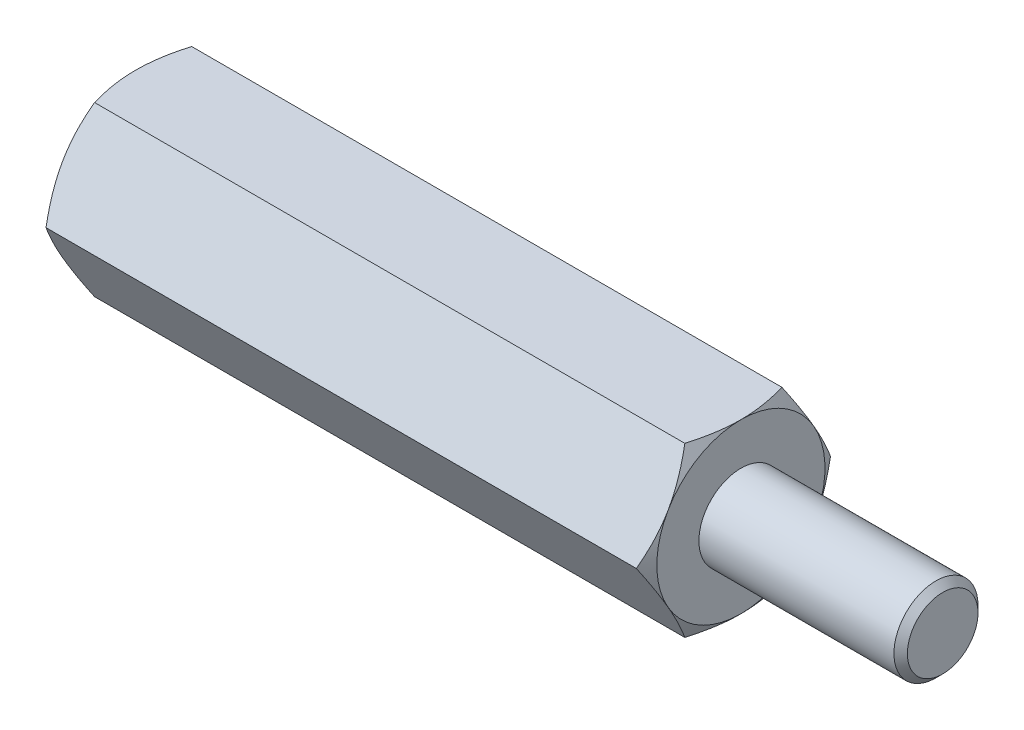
from build123d import *

# Parameters (mm, degrees)
EXTRUDE2_DEPTH = 9
SKETCH3_R      = 1.05
EXTRUDE3_DEPTH = 6
SKETCH5_R      = 1.25
EXTRUDE4_DEPTH = 6
CHAMFER1_SIZE  = 0.2


with BuildPart() as part:
    # Sketch1 → Extrude2 (new, symmetric)
    with BuildSketch(Plane(origin=(0, 0, 0), x_dir=(0, 0, -1), z_dir=(1, 0, 0))):
        Polygon((1.443375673, 2.5), (-1.443375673, 2.5), (-2.886751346, 0), (-1.443375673, -2.5), (1.443375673, -2.5), (2.886751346, 0), align=None)
    extrude(amount=EXTRUDE2_DEPTH, both=True)

    # Sketch2 → Cut-Revolve1 (revolve, cut)
    with BuildSketch(Plane.XY):
        with BuildLine():
            Line((-9, 2.5), (-7.5, 5.098076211))
            ThreePointArc((-7.5, 5.098076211), (-7.98810136, 6.276457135), (-9, 5.5))
            Line((-9, 5.5), (-9, 2.5))
        make_face()
    cut_revolve1 = revolve(axis=Axis((0, 0, 0), (1, 0, 0)), mode=Mode.SUBTRACT)

    # Mirror1: Cut-Revolve1 across plane
    add(cut_revolve1.mirror(Plane(origin=(0, 0, 0), x_dir=(0, 0, 1), z_dir=(1, 0, 0))), mode=Mode.SUBTRACT)

    # Sketch3 → Extrude3 (cut)
    with BuildSketch(Plane.ZY.offset(9)):
        Circle(SKETCH3_R)
    extrude(amount=-EXTRUDE3_DEPTH, mode=Mode.SUBTRACT)

    # Sketch4 → Cut-Revolve2 (revolve, cut)
    with BuildSketch(Plane.XY, mode=Mode.PRIVATE) as cut_revolve2_sk:
        Polygon((-3, 0), (-3, 1.05), (-2.393782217, 0), align=None)
    revolve(cut_revolve2_sk.sketch.rotate(Axis((-2.393782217, 0, 0), (-1, 0, 0)), 270), axis=Axis((-2.393782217, 0, 0), (-1, 0, 0)), mode=Mode.SUBTRACT)

    # Sketch5 → Extrude4 (add)
    with BuildSketch(Plane(origin=(9, 0, 0), x_dir=(0, 0, -1), z_dir=(1, 0, 0))):
        Circle(SKETCH5_R)
    extrude(amount=EXTRUDE4_DEPTH)

    # Chamfer1
    chamfer1_edges = [part.edges().sort_by_distance(p)[0] for p in [
        (15, 0, 1.25),
    ]]
    chamfer(chamfer1_edges, length=CHAMFER1_SIZE)


solid = part.part
